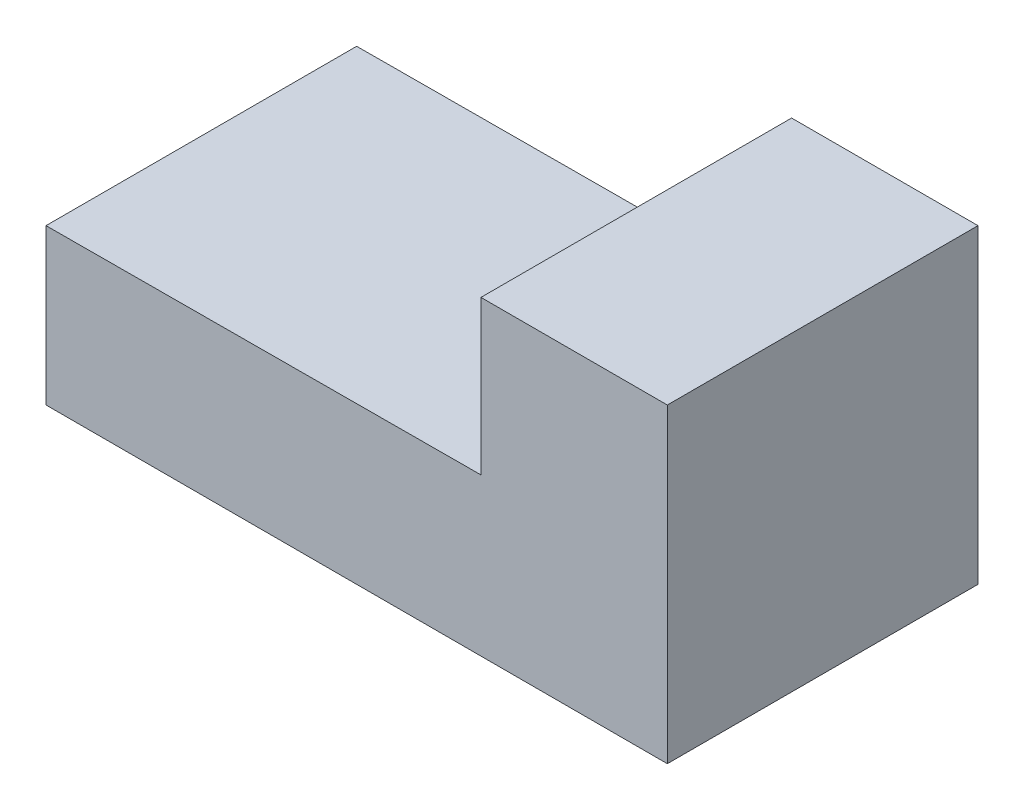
from build123d import *

# Parameters (mm, degrees)
RESSALTO_EXTRUS_O1_DEPTH = 30


with BuildPart() as part:
    # Esbo_o1 → Ressalto-extrus_o1 (new body)
    with BuildSketch(Plane.XY):
        Polygon((0, 0), (0, -15), (60, -15), (60, 15), (42, 15), (42, 0.15625), align=None)
    extrude(amount=RESSALTO_EXTRUS_O1_DEPTH)


solid = part.part
